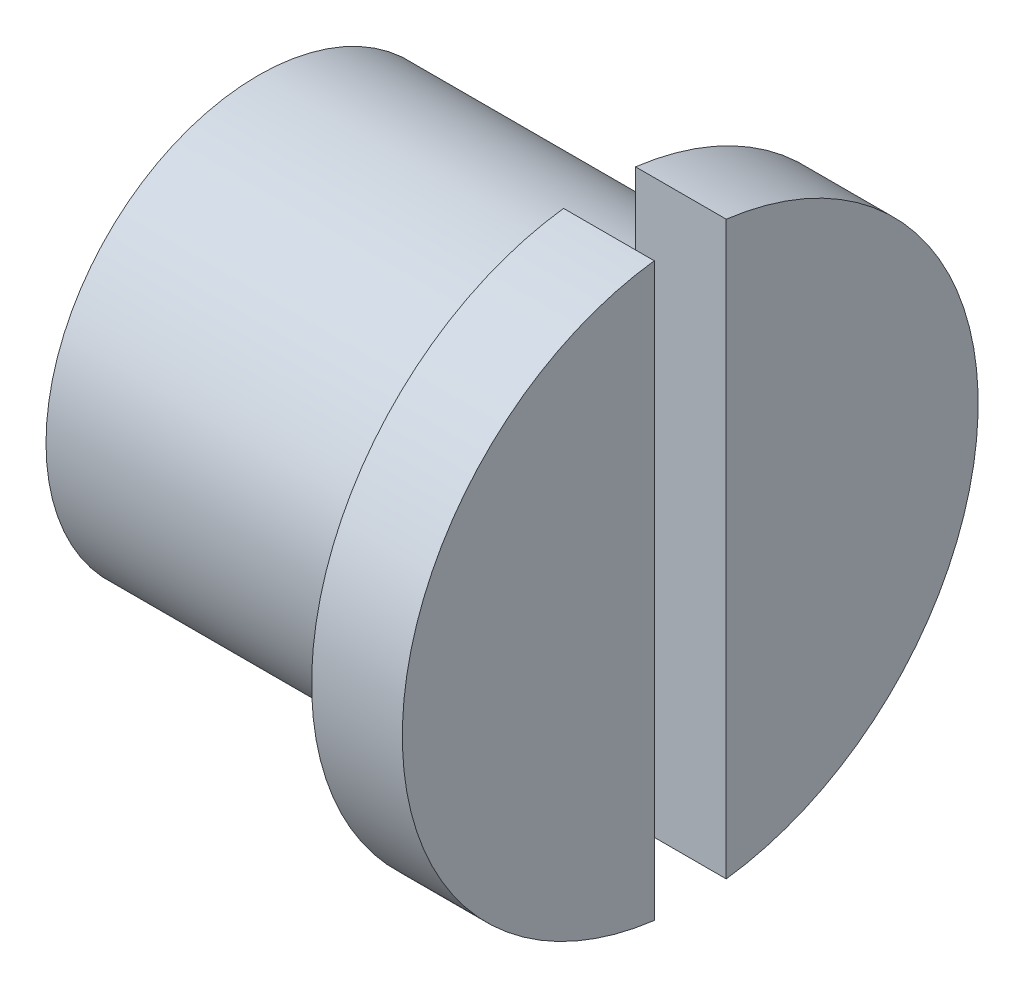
from build123d import *

# Parameters (mm, degrees)
SKETCH3_W          = 1.27
SKETCH3_H          = 10.683807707
CUT_EXTRUDE1_DEPTH = 1.6002


with BuildPart() as part:
    # Sketch1 → Revolve1 (revolve)
    with BuildSketch(Plane.XY):
        Polygon((0, 0), (0, 3.7465), (6.0198, 3.7465), (6.0198, 5.08), (7.62, 5.08), (7.62, 0), align=None)
    revolve(axis=Axis((7.62, 0, 0), (-1, 0, 0)))

    # Sketch3 → Cut-Extrude1 (cut)
    with BuildSketch(Plane(origin=(7.62, 0, 0), x_dir=(0, 0, -1), z_dir=(1, 0, 0))):
        with Locations((0, -0.049309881)):
            Rectangle(SKETCH3_W, SKETCH3_H)
    extrude(amount=-CUT_EXTRUDE1_DEPTH, mode=Mode.SUBTRACT)


solid = part.part
